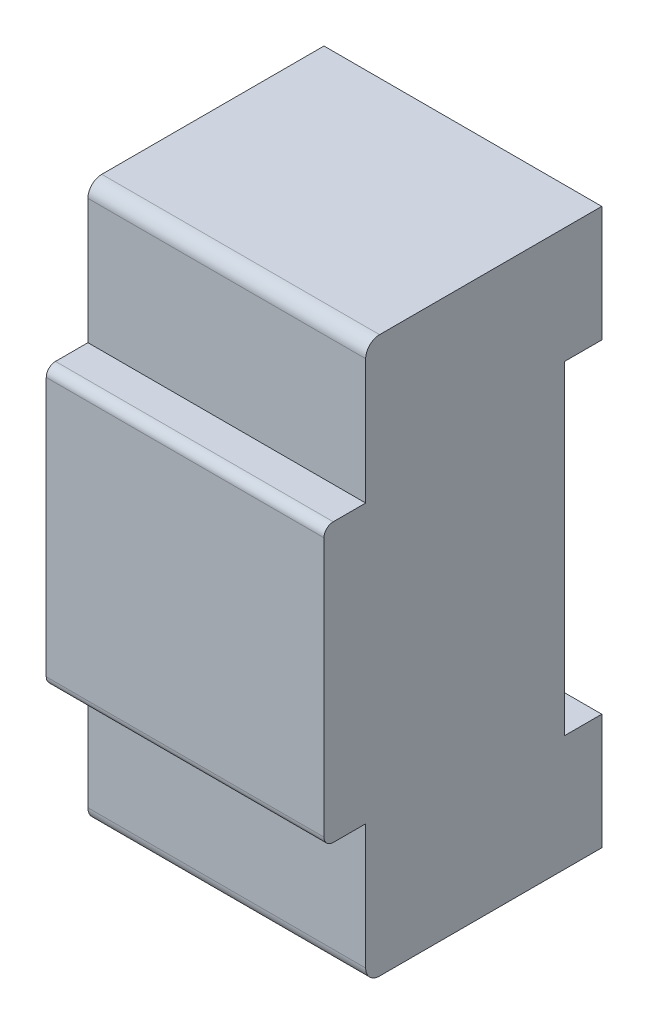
from build123d import *

# Parameters (mm, degrees)
EW_EXTRUDE_DEPTH = 30
FILLET1_R        = 1.5
FILLET2_R        = 1


with BuildPart() as part:
    # EW_SKETCH → EW_EXTRUDE (new body)
    with BuildSketch(Plane(origin=(0, 0, 0), x_dir=(0, 0, -1), z_dir=(1, 0, 0))):
        Polygon((0, 0), (4, 0), (4, 12.5), (-21.5, 12.5), (-21.5, -2.5), (-26, -2.5), (-26, -32.5), (-21.5, -32.5), (-21.5, -47.5), (4, -47.5), (4, -35), (0, -35), align=None)
    extrude(amount=EW_EXTRUDE_DEPTH)

    # fillet1
    fillet1_edges = [part.edges().sort_by_distance(p)[0] for p in [
        (15, -47.5, 21.5),
        (15, 12.5, 21.5),
    ]]
    fillet(fillet1_edges, radius=FILLET1_R)

    # fillet2
    fillet2_edges = [part.edges().sort_by_distance(p)[0] for p in [
        (15, -32.5, 26),
        (15, -2.5, 26),
    ]]
    fillet(fillet2_edges, radius=FILLET2_R)


solid = part.part
